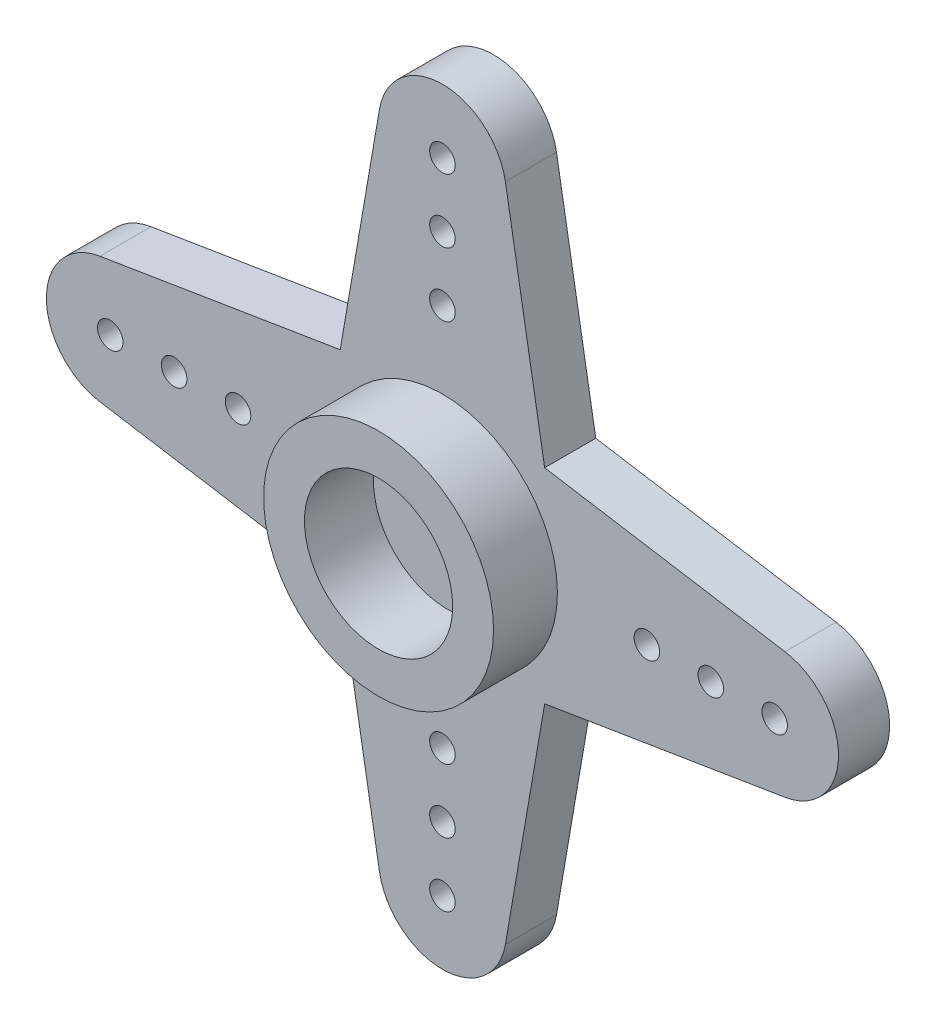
from build123d import *

# Parameters (mm, degrees)
ESQUISSE1_R      = 0.5
EXTRUSION1_DEPTH = 2
ESQUISSE2_R      = 3.75
EXTRUSION2_DEPTH = 0.5
ESQUISSE3_R      = 4.5
EXTRUSION3_DEPTH = 2.5
ESQUISSE4_R      = 2.9
EXTRUSION4_DEPTH = 2.7


with BuildPart() as part:
    # Esquisse1 → Extrusion1 (new body)
    with BuildSketch(Plane.XY):
        with BuildLine():
            Line((-13.402193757, 2.467435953), (-4, 4))
            Line((-4, 4), (-2.463761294, 12.924122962))
            ThreePointArc((-2.463761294, 12.924122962), (0, 15), (2.463761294, 12.924122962))
            Line((2.463761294, 12.924122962), (4, 4))
            Line((4, 4), (13.402193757, 2.467435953))
            ThreePointArc((13.402193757, 2.467435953), (15.5, 0), (13.402193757, -2.467435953))
            Line((13.402193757, -2.467435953), (4, -4))
            Line((4, -4), (2.463761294, -12.924122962))
            ThreePointArc((2.463761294, -12.924122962), (0, -15), (-2.463761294, -12.924122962))
            Line((-2.463761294, -12.924122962), (-4, -4))
            Line((-4, -4), (-13.402193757, -2.467435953))
            ThreePointArc((-13.402193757, -2.467435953), (-15.5, 0), (-13.402193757, 2.467435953))
        make_face()
        with Locations((0, 12.5)):
            Circle(ESQUISSE1_R, mode=Mode.SUBTRACT)
        with Locations((0, 10)):
            Circle(ESQUISSE1_R, mode=Mode.SUBTRACT)
        with Locations((-13, 0)):
            Circle(ESQUISSE1_R, mode=Mode.SUBTRACT)
        with Locations((-10.5, 0)):
            Circle(ESQUISSE1_R, mode=Mode.SUBTRACT)
        with Locations((-8, 0)):
            Circle(ESQUISSE1_R, mode=Mode.SUBTRACT)
        with Locations((8, 0)):
            Circle(ESQUISSE1_R, mode=Mode.SUBTRACT)
        with Locations((10.5, 0)):
            Circle(ESQUISSE1_R, mode=Mode.SUBTRACT)
        with Locations((13, 0)):
            Circle(ESQUISSE1_R, mode=Mode.SUBTRACT)
        with Locations((0, 7.5)):
            Circle(ESQUISSE1_R, mode=Mode.SUBTRACT)
        with Locations((0, -7.5)):
            Circle(ESQUISSE1_R, mode=Mode.SUBTRACT)
        with Locations((0, -10)):
            Circle(ESQUISSE1_R, mode=Mode.SUBTRACT)
        with Locations((0, -12.5)):
            Circle(ESQUISSE1_R, mode=Mode.SUBTRACT)
    extrude(amount=EXTRUSION1_DEPTH)

    # Esquisse2 → Extrusion2 (add)
    with BuildSketch(Plane(origin=(0, 0, 0), x_dir=(-1, 0, 0), z_dir=(0, 0, -1))):
        with Locations(Location((0, 0, 0), (0, 0, 180))):
            Circle(ESQUISSE2_R)
    extrude(amount=EXTRUSION2_DEPTH)

    # Esquisse3 → Extrusion3 (add)
    with BuildSketch(Plane.XY.offset(2)):
        Circle(ESQUISSE3_R)
    extrude(amount=EXTRUSION3_DEPTH)

    # Esquisse4 → Extrusion4 (cut)
    with BuildSketch(Plane.XY.offset(4.5)):
        Circle(ESQUISSE4_R)
    extrude(amount=-EXTRUSION4_DEPTH, mode=Mode.SUBTRACT)


solid = part.part
